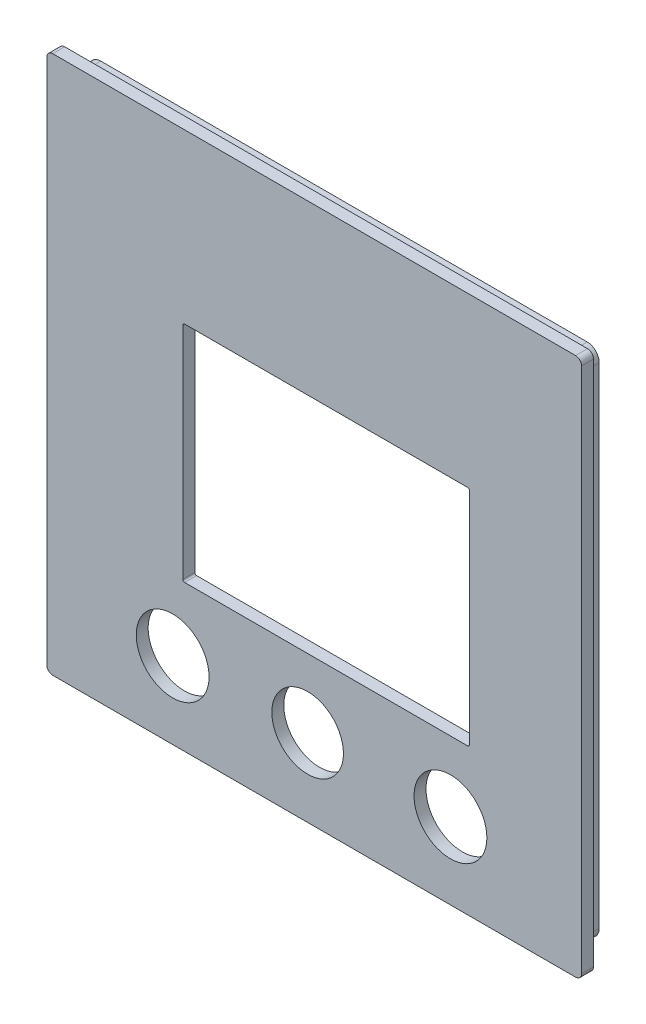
from build123d import *

# Parameters (mm, degrees)
SKETCH1_W           = 81.6
SKETCH1_H           = 82.2
SKETCH1_R           = 1
SKETCH1_R_2         = 6.1
SKETCH1_W_2         = 54.4
SKETCH1_H_2         = 37.5
BOSS_EXTRUDE1_DEPTH = 2
FILLET1_R           = 0.3
SKETCH2_W           = 82
SKETCH2_H           = 82.6
SKETCH2_W_2         = 79.2
SKETCH2_H_2         = 79.8
BOSS_EXTRUDE2_DEPTH = 3
SKETCH3_R           = 6
CUT_EXTRUDE1_DEPTH  = 3
SKETCH4_R           = 8.17705111
SKETCH4_R_2         = 6
BOSS_EXTRUDE3_DEPTH = 2
SKETCH5_W           = 89.6
SKETCH5_H           = 90.2
SKETCH5_W_2         = 81.6
SKETCH5_H_2         = 82.2
BOSS_EXTRUDE4_DEPTH = 2
SKETCH6_W           = 0.654271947
SKETCH6_H           = 38.113717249
BOSS_EXTRUDE5_DEPTH = 2
SKETCH7_W           = 6
SKETCH7_H           = 37.5
BOSS_EXTRUDE6_DEPTH = 2
FILLET2_R           = 0.3
FILLET3_R           = 1
SKETCH8_W           = 82
SKETCH8_H           = 82.6
CUT_EXTRUDE2_DEPTH  = 3
BOSS_EXTRUDE7_DEPTH = 3


with BuildPart() as part:
    # Sketch1 → Boss-Extrude1 (new body)
    with BuildSketch(Plane.XY):
        with Locations((-68.175, -59.344211)):
            Rectangle(SKETCH1_W, SKETCH1_H)
        with Locations((-69.468414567, -91.880172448)):
            Circle(SKETCH1_R, mode=Mode.SUBTRACT)
        with Locations((-45.345134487, -91.653485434)):
            Circle(SKETCH1_R_2, mode=Mode.SUBTRACT)
        with Locations((-91.893304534, -91.57750339)):
            Circle(SKETCH1_R_2, mode=Mode.SUBTRACT)
        with BuildLine():
            ThreePointArc((-61.900884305, -92.581945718), (-61.868414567, -91.880172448), (-61.900884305, -91.178399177))
            Line((-61.900884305, -91.178399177), (-64.517908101, -91.178399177))
            ThreePointArc((-64.517908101, -91.178399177), (-64.468414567, -91.880172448), (-64.517908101, -92.581945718))
            Line((-64.517908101, -92.581945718), (-61.900884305, -92.581945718))
        make_face(mode=Mode.SUBTRACT)
        with BuildLine():
            ThreePointArc((-77.03594483, -91.178399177), (-77.068414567, -91.880172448), (-77.03594483, -92.581945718))
            Line((-77.03594483, -92.581945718), (-74.418921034, -92.581945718))
            ThreePointArc((-74.418921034, -92.581945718), (-74.468414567, -91.880172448), (-74.418921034, -91.178399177))
            Line((-74.418921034, -91.178399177), (-77.03594483, -91.178399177))
        make_face(mode=Mode.SUBTRACT)
        with Locations((-69.375, -61.174211)):
            Rectangle(SKETCH1_W_2, SKETCH1_H_2, mode=Mode.SUBTRACT)
        with BuildLine():
            Line((-68.781157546, -86.92762989), (-68.781157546, -84.395858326))
            Line((-68.781157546, -84.395858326), (-70.155671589, -84.395858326))
            Line((-70.155671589, -84.395858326), (-70.155671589, -86.92762989))
            ThreePointArc((-70.155671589, -86.92762989), (-69.468414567, -86.880172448), (-68.781157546, -86.92762989))
        make_face(mode=Mode.SUBTRACT)
        with BuildLine():
            Line((-70.155671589, -99.364486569), (-70.155671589, -96.832715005))
            ThreePointArc((-70.155671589, -96.832715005), (-69.468414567, -96.880172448), (-68.781157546, -96.832715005))
            Line((-68.781157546, -96.832715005), (-68.781157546, -99.364486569))
            Line((-68.781157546, -99.364486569), (-70.155671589, -99.364486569))
        make_face(mode=Mode.SUBTRACT)
    extrude(amount=BOSS_EXTRUDE1_DEPTH)

    # Fillet1
    fillet1_edges = [part.edges().sort_by_distance(p)[0] for p in [
        (-42.175, -42.424211, 1),
        (-96.575, -42.424211, 1),
        (-96.575, -79.924211, 1),
        (-42.175, -79.924211, 1),
    ]]
    fillet(fillet1_edges, radius=FILLET1_R)

    # Sketch2 → Boss-Extrude2 (add)
    with BuildSketch(Plane(origin=(0, 0, 0), x_dir=(-1, 0, 0), z_dir=(0, 0, -1))):
        with Locations((68.175, -59.344211)):
            Rectangle(SKETCH2_W, SKETCH2_H)
        with Locations((68.175, -59.344211)):
            Rectangle(SKETCH2_W_2, SKETCH2_H_2, mode=Mode.SUBTRACT)
    extrude(amount=BOSS_EXTRUDE2_DEPTH)

    # Sketch3 → Cut-Extrude1 (cut)
    with BuildSketch(Plane.XY.offset(2)):
        with Locations((-69.275, -91.444211)):
            Circle(SKETCH3_R)
    extrude(amount=-CUT_EXTRUDE1_DEPTH, mode=Mode.SUBTRACT)

    # Sketch4 → Boss-Extrude3 (add)
    with BuildSketch(Plane.XY.offset(2)):
        with Locations((-69.275, -91.444211)):
            Circle(SKETCH4_R)
        with Locations((-69.275, -91.444211)):
            Circle(SKETCH4_R_2, mode=Mode.SUBTRACT)
    extrude(amount=-BOSS_EXTRUDE3_DEPTH)

    # Sketch5 → Boss-Extrude4 (add)
    with BuildSketch(Plane.XY.offset(2)):
        with Locations((-68.175, -59.344211)):
            Rectangle(SKETCH5_W, SKETCH5_H)
        with Locations((-68.175, -59.344211)):
            Rectangle(SKETCH5_W_2, SKETCH5_H_2, mode=Mode.SUBTRACT)
    extrude(amount=-BOSS_EXTRUDE4_DEPTH)

    # Sketch6 → Boss-Extrude5 (add)
    with BuildSketch(Plane.XY.offset(2)):
        with Locations((-96.502135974, -61.481069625)):
            Rectangle(SKETCH6_W, SKETCH6_H)
    extrude(amount=-BOSS_EXTRUDE5_DEPTH)

    # Sketch7 → Boss-Extrude6 (add)
    with BuildSketch(Plane.XY.offset(2)):
        with Locations((-93.175, -61.174211)):
            Rectangle(SKETCH7_W, SKETCH7_H)
    extrude(amount=-BOSS_EXTRUDE6_DEPTH)

    # Fillet2
    fillet2_edges = [part.edges().sort_by_distance(p)[0] for p in [
        (-90.175, -42.424211, 1),
        (-90.175, -79.924211, 1),
    ]]
    fillet(fillet2_edges, radius=FILLET2_R)

    # Fillet3
    fillet3_edges = [part.edges().sort_by_distance(p)[0] for p in [
        (-112.975, -14.244211, 1),
        (-23.375, -14.244211, 1),
        (-23.375, -104.444211, 1),
        (-112.975, -104.444211, 1),
    ]]
    fillet(fillet3_edges, radius=FILLET3_R)

    # Sketch8 → Cut-Extrude2 (cut)
    with BuildSketch(Plane(origin=(0, 0, -3), x_dir=(-1, 0, 0), z_dir=(0, 0, -1))):
        with Locations((68.175, -59.344211)):
            Rectangle(SKETCH8_W, SKETCH8_H)
    extrude(amount=-CUT_EXTRUDE2_DEPTH, mode=Mode.SUBTRACT)

    # Sketch9 → Boss-Extrude7 (add)
    with BuildSketch(Plane(origin=(0, 0, 0), x_dir=(-1, 0, 0), z_dir=(0, 0, -1))):
        with BuildLine():
            Line((27.425, -16.294211), (108.925, -16.294211))
            ThreePointArc((108.925, -16.294211), (110.339213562, -16.879997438), (110.925, -18.294211))
            Line((110.925, -18.294211), (110.925, -100.394211))
            ThreePointArc((110.925, -100.394211), (110.339213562, -101.808424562), (108.925, -102.394211))
            Line((108.925, -102.394211), (27.425, -102.394211))
            ThreePointArc((27.425, -102.394211), (26.010786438, -101.808424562), (25.425, -100.394211))
            Line((25.425, -100.394211), (25.425, -18.294211))
            ThreePointArc((25.425, -18.294211), (26.010786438, -16.879997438), (27.425, -16.294211))
        make_face()
        with BuildLine():
            Line((27.425, -17.794211), (108.925, -17.794211))
            ThreePointArc((108.925, -17.794211), (109.278553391, -17.940657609), (109.425, -18.294211))
            Line((109.425, -18.294211), (109.425, -100.394211))
            ThreePointArc((109.425, -100.394211), (109.278553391, -100.747764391), (108.925, -100.894211))
            Line((108.925, -100.894211), (27.425, -100.894211))
            ThreePointArc((27.425, -100.894211), (27.071446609, -100.747764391), (26.925, -100.394211))
            Line((26.925, -100.394211), (26.925, -18.294211))
            ThreePointArc((26.925, -18.294211), (27.071446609, -17.940657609), (27.425, -17.794211))
        make_face(mode=Mode.SUBTRACT)
    extrude(amount=BOSS_EXTRUDE7_DEPTH)


solid = part.part
